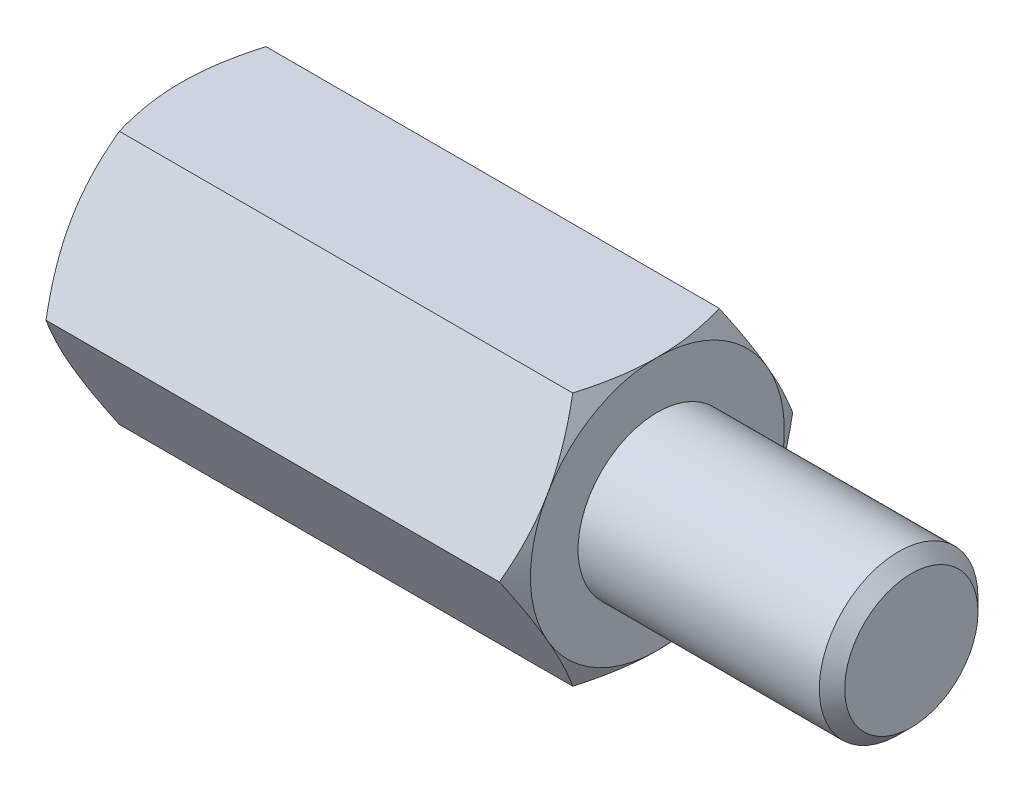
from build123d import *

# Parameters (mm, degrees)
EXTRUDE2_DEPTH = 7.5
SKETCH3_R      = 2.1
EXTRUDE3_DEPTH = 8
SKETCH5_R      = 2.5
EXTRUDE4_DEPTH = 8
CHAMFER1_SIZE  = 0.4


with BuildPart() as part:
    # Sketch1 → Extrude2 (new, symmetric)
    with BuildSketch(Plane(origin=(0, 0, 0), x_dir=(0, 0, -1), z_dir=(1, 0, 0))):
        Polygon((2.309401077, 4), (-2.309401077, 4), (-4.618802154, 0), (-2.309401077, -4), (2.309401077, -4), (4.618802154, 0), align=None)
    extrude(amount=EXTRUDE2_DEPTH, both=True)

    # Sketch2 → Cut-Revolve1 (revolve, cut)
    with BuildSketch(Plane.XY):
        with BuildLine():
            Line((-7.5, 4), (-6, 6.598076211))
            ThreePointArc((-6, 6.598076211), (-6.48810136, 7.776457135), (-7.5, 7))
            Line((-7.5, 7), (-7.5, 4))
        make_face()
    cut_revolve1 = revolve(axis=Axis((0, 0, 0), (1, 0, 0)), mode=Mode.SUBTRACT)

    # Mirror1: Cut-Revolve1 across plane
    add(cut_revolve1.mirror(Plane(origin=(0, 0, 0), x_dir=(0, 0, 1), z_dir=(1, 0, 0))), mode=Mode.SUBTRACT)

    # Sketch3 → Extrude3 (cut)
    with BuildSketch(Plane.ZY.offset(7.5)):
        Circle(SKETCH3_R)
    extrude(amount=-EXTRUDE3_DEPTH, mode=Mode.SUBTRACT)

    # Sketch4 → Cut-Revolve2 (revolve, cut)
    with BuildSketch(Plane.XY, mode=Mode.PRIVATE) as cut_revolve2_sk:
        Polygon((0.5, 0), (0.5, 2.1), (1.712435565, 0), align=None)
    revolve(cut_revolve2_sk.sketch.rotate(Axis((1.712435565, 0, 0), (-1, 0, 0)), 180), axis=Axis((1.712435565, 0, 0), (-1, 0, 0)), mode=Mode.SUBTRACT)

    # Sketch5 → Extrude4 (add)
    with BuildSketch(Plane(origin=(7.5, 0, 0), x_dir=(0, 0, -1), z_dir=(1, 0, 0))):
        Circle(SKETCH5_R)
    extrude(amount=EXTRUDE4_DEPTH)

    # Chamfer1
    chamfer1_edges = [part.edges().sort_by_distance(p)[0] for p in [
        (15.5, 0, 2.5),
    ]]
    chamfer(chamfer1_edges, length=CHAMFER1_SIZE)


solid = part.part
